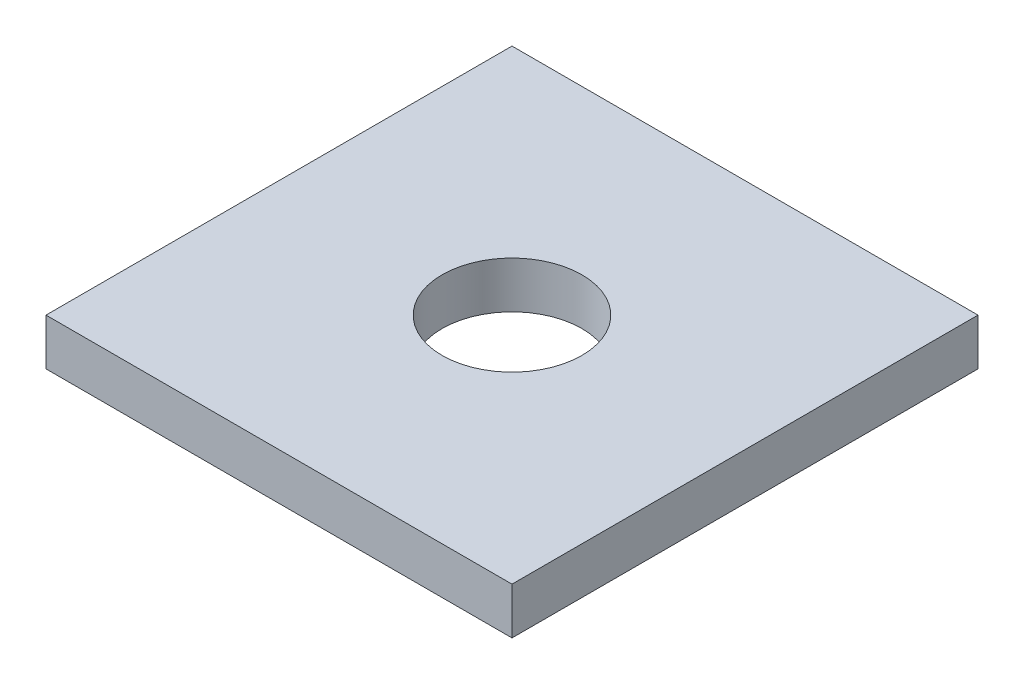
from build123d import *

# Parameters (mm, degrees)
SKETCH1_W      = 30
SKETCH1_H      = 30
SKETCH1_R      = 4.5
EXTRUDE1_DEPTH = 3


with BuildPart() as part:
    # Sketch1 → Extrude1 (new body)
    with BuildSketch(Plane(origin=(0, 0, 0), x_dir=(1, 0, 0), z_dir=(0, 1, 0))):
        with Locations((15, 15)):
            Rectangle(SKETCH1_W, SKETCH1_H)
        with Locations(Location((15, 15, 0), (0, 0, 270))):
            Circle(SKETCH1_R, mode=Mode.SUBTRACT)
    extrude(amount=EXTRUDE1_DEPTH)


solid = part.part
